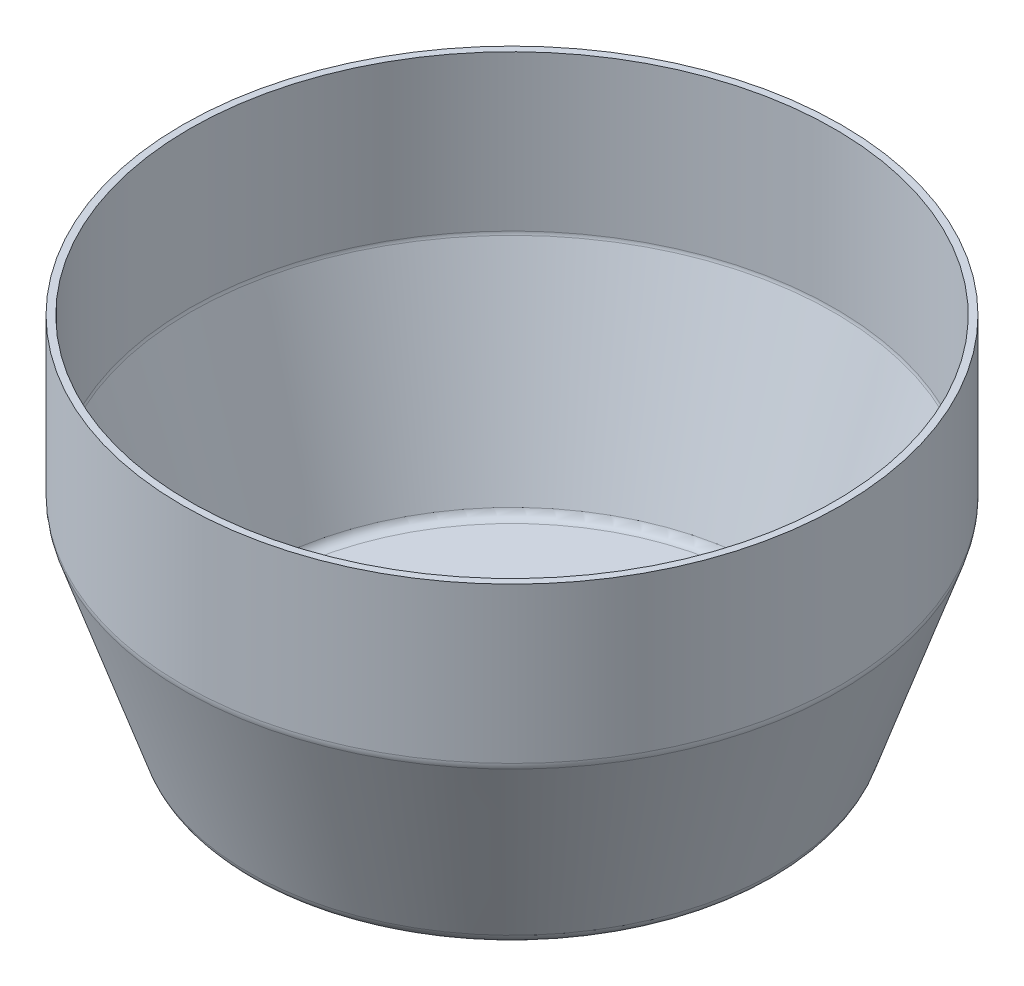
from build123d import *

# Parameters (mm, degrees)
ESQUISSE2_R                  = 30.25
ENL_V_MAT_EXTRU_3_DEPTH      = 170.851405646
ESQUISSE4_R                  = 2.75
TROU_D_BOUCHANT_DE_6_5_DEPTH = 170.851405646
R_P_TITION_CIRCULAIRE1_COUNT = 6
ESQUISSE5_R                  = 8
ENL_V_MAT_EXTRU_6_DEPTH      = 170.851405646


with BuildPart() as part:
    # Esquisse1 → R_volution3 (revolve)
    with BuildSketch(Plane.XY):
        with BuildLine():
            Line((-93.5, 0), (-93.5, -45))
            ThreePointArc((-93.5, -45), (-93.459459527, -45.491527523), (-93.338933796, -45.969770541))
            Line((-93.338933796, -45.969770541), (-74.55111287, -100.969770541))
            ThreePointArc((-74.55111287, -100.969770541), (-73.457270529, -102.440216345), (-71.712179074, -103))
            Line((-71.712179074, -103), (0, -103))
            Line((0, -103), (0, -105))
            Line((0, -105), (-71.712179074, -105))
            ThreePointArc((-71.712179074, -105), (-74.620664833, -104.067027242), (-76.4437354, -101.616284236))
            Line((-76.4437354, -101.616284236), (-95.231556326, -46.616284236))
            ThreePointArc((-95.231556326, -46.616284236), (-95.432432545, -45.819212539), (-95.5, -45))
            Line((-95.5, -45), (-95.5, 0))
            Line((-95.5, 0), (-93.5, 0))
        make_face()
    revolve(axis=Axis((0, 38.398623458, 0), (0, -1, 0)))

    # Esquisse2 → Enl_v. mat.-Extru.3 (cut, through all)
    with BuildSketch(Plane(origin=(0, -103, 0), x_dir=(-1, 0, 0), z_dir=(0, 1, 0))):
        with Locations(Location((0, 0, 0), (0, 0, 90))):
            Circle(ESQUISSE2_R)
    extrude(amount=-ENL_V_MAT_EXTRU_3_DEPTH, mode=Mode.SUBTRACT)

    # Esquisse4 → Trou d_bouchant de 6.5 (cut, through all)
    with BuildSketch(Plane(origin=(0, -103, 0), x_dir=(1, 0, 0), z_dir=(0, 1, 0))):
        with Locations(Location((-42, 0, 0), (0, 0, 270))):
            Circle(ESQUISSE4_R)
    trou_d_bouchant_de_6_5 = extrude(amount=-TROU_D_BOUCHANT_DE_6_5_DEPTH, mode=Mode.SUBTRACT)

    # R_p_tition circulaire1: Trou d_bouchant de 6.5 ×6 about axis
    r_p_tition_circulaire1_axis = Axis((0, 0, 0), (0, 1, 0))
    for i in range(1, R_P_TITION_CIRCULAIRE1_COUNT):
        add(trou_d_bouchant_de_6_5.rotate(r_p_tition_circulaire1_axis, i * 360 / R_P_TITION_CIRCULAIRE1_COUNT), mode=Mode.SUBTRACT)

    # Esquisse5 → Enl_v. mat.-Extru.6 (cut, through all)
    with BuildSketch(Plane(origin=(0, -103, 0), x_dir=(1, 0, 0), z_dir=(0, 1, 0))):
        with Locations(Location((-60, 0, 0), (0, 0, 270))):
            Circle(ESQUISSE5_R)
    extrude(amount=-ENL_V_MAT_EXTRU_6_DEPTH, mode=Mode.SUBTRACT)


solid = part.part
